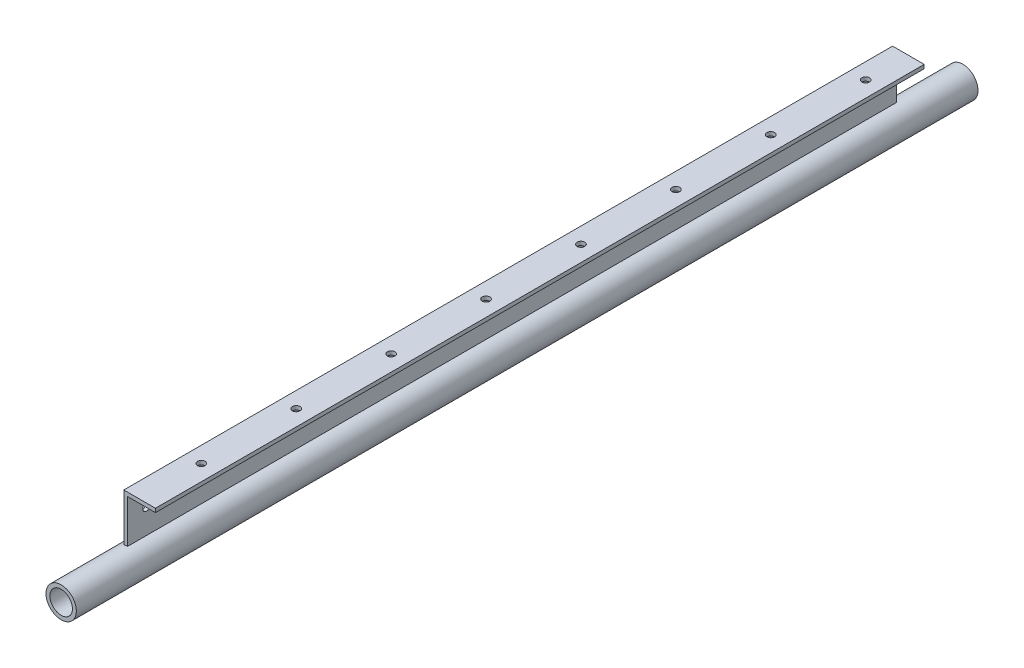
from build123d import *

# Parameters (mm, degrees)
ESQUISSE1_R                = 17.85
BASE_EXTRUSION_DEPTH       = 1425
ENL_V_START                = -105
ENL_V_MAT_EXTRU_1_DEPTH    = 105
ENL_V_MAT_EXTRU_2_DEPTH    = 105
ESQUISSE4_R                = 6
ENL_V_MAT_EXTRU_3_DEPTH    = 1430.257039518
R_P_TITION_LIN_AIRE1_COUNT = 16
R_P_TITION_LIN_AIRE1_PITCH = 75
ESQUISSE5_R                = 6
ENL_V_MAT_EXTRU_4_DEPTH    = 7
R_P_TITION_LIN_AIRE2_COUNT = 8
R_P_TITION_LIN_AIRE2_PITCH = 150


with BuildPart() as part:
    # Esquisse1 → Base-Extrusion (new body)
    with BuildSketch(Plane.XY):
        with BuildLine():
            Line((0, 92.237900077), (0, 24))
            ThreePointArc((0, 24), (3.02410302, -23.80871271), (-6, 23.237900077))
            Line((-6, 23.237900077), (-6, 98.237900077))
            Line((-6, 98.237900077), (44, 98.237900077))
            Line((44, 98.237900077), (44, 92.237900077))
            Line((44, 92.237900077), (0, 92.237900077))
        make_face()
        Circle(ESQUISSE1_R, mode=Mode.SUBTRACT)
    extrude(amount=BASE_EXTRUSION_DEPTH)

    # Esquisse2 → Enl_v. mat.-Extru.1 (cut)
    with BuildSketch(Plane.XY.offset(1425).offset(ENL_V_START)):
        with BuildLine():
            Line((-6, 98.237900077), (-6, 23.237900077))
            ThreePointArc((-6, 23.237900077), (-3.02410302, 23.80871271), (0, 24))
            Line((0, 24), (0, 92.237900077))
            Line((0, 92.237900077), (44, 92.237900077))
            Line((44, 92.237900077), (44, 98.237900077))
            Line((44, 98.237900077), (-6, 98.237900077))
        make_face()
    extrude(amount=ENL_V_MAT_EXTRU_1_DEPTH, mode=Mode.SUBTRACT)

    # Esquisse3 → Enl_v. mat.-Extru.2 (cut)
    with BuildSketch(Plane(origin=(0, 0, 0), x_dir=(-1, 0, 0), z_dir=(0, 0, -1))):
        with BuildLine():
            Line((-44, 98.237900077), (6, 98.237900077))
            Line((6, 98.237900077), (6, 23.237900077))
            ThreePointArc((6, 23.237900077), (3.02410302, 23.80871271), (0, 24))
            Line((0, 24), (0, 92.237900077))
            Line((0, 92.237900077), (-44, 92.237900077))
            Line((-44, 92.237900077), (-44, 98.237900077))
        make_face()
    extrude(amount=-ENL_V_MAT_EXTRU_2_DEPTH, mode=Mode.SUBTRACT)

    # Esquisse4 → Enl_v. mat.-Extru.3 (cut, through all)
    with BuildSketch(Plane.ZY.offset(6)):
        with Locations(Location((1290, 63.237900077, 0), (0, 0, 270))):
            Circle(ESQUISSE4_R)
    enl_v_mat_extru_3 = extrude(amount=-ENL_V_MAT_EXTRU_3_DEPTH, mode=Mode.SUBTRACT)

    # R_p_tition lin_aire1: Enl_v. mat.-Extru.3 ×16
    with Locations(*[(0, 0, -i * R_P_TITION_LIN_AIRE1_PITCH) for i in range(1, R_P_TITION_LIN_AIRE1_COUNT)]):
        add(enl_v_mat_extru_3, mode=Mode.SUBTRACT)

    # Esquisse5 → Enl_v. mat.-Extru.4 (cut)
    with BuildSketch(Plane(origin=(0, 98.237900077, 0), x_dir=(-1, 0, 0), z_dir=(0, 1, 0))):
        with Locations(Location((-19, 172.5, 0), (0, 0, 90))):
            Circle(ESQUISSE5_R)
    enl_v_mat_extru_4 = extrude(amount=-ENL_V_MAT_EXTRU_4_DEPTH, mode=Mode.SUBTRACT)

    # R_p_tition lin_aire2: Enl_v. mat.-Extru.4 ×8
    with Locations(*[(0, 0, i * R_P_TITION_LIN_AIRE2_PITCH) for i in range(1, R_P_TITION_LIN_AIRE2_COUNT)]):
        add(enl_v_mat_extru_4, mode=Mode.SUBTRACT)


solid = part.part
